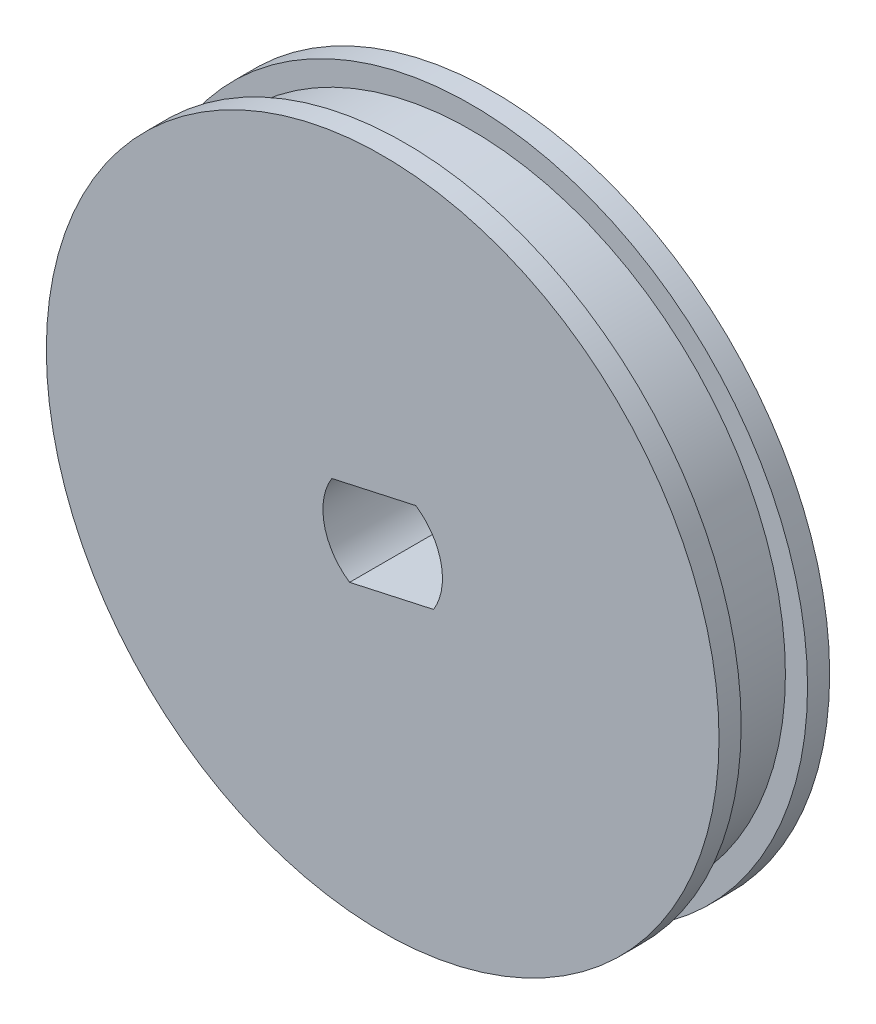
from build123d import *

# Parameters (mm, degrees)
SKETCH_1_R          = 14.2
EXTRUDE_1_DEPTH     = 1.5
SKETCH_2_R          = 15.2
EXTRUDE_2_DEPTH     = 1
CUT_EXTRUDE_1_DEPTH = 48.703848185


with BuildPart() as part:
    # Sketch 1 → Extrude 1 (new, symmetric)
    with BuildSketch(Plane.XY):
        with Locations((22.416532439, -13.707674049)):
            Circle(SKETCH_1_R)
    extrude(amount=EXTRUDE_1_DEPTH, both=True)

    # Sketch 2 → Extrude 2 (add)
    with BuildSketch(Plane.XY.offset(1.5)):
        with Locations((22.416532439, -13.707674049)):
            Circle(SKETCH_2_R)
    extrude_2 = extrude(amount=EXTRUDE_2_DEPTH)

    # Mirror 1: Extrude 2 across plane
    add(extrude_2.mirror(Plane.XY))

    # Sketch 3 → Cut-Extrude 1 (cut, through all)
    with BuildSketch(Plane.XY.offset(2.5)):
        with BuildLine():
            Line((23.910655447, -11.458763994), (20.116007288, -12.294314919))
            ThreePointArc((20.116007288, -12.294314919), (19.779698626, -14.288283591), (20.92240943, -15.956584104))
            Line((20.92240943, -15.956584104), (24.71705759, -15.121033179))
            ThreePointArc((24.71705759, -15.121033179), (25.053366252, -13.127064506), (23.910655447, -11.458763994))
        make_face()
    extrude(amount=-CUT_EXTRUDE_1_DEPTH, mode=Mode.SUBTRACT)


solid = part.part
